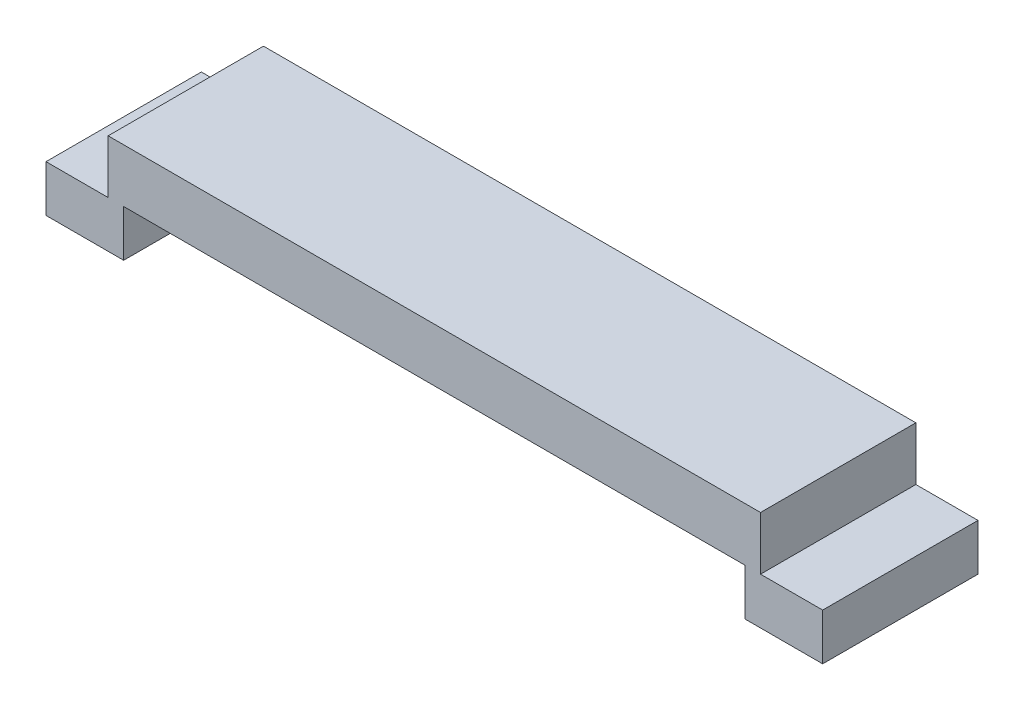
ISO-10303-21;
HEADER;
FILE_DESCRIPTION(('STEP AP214'),'2;1');
FILE_NAME('part.step','',(''),(''),'','','');
FILE_SCHEMA(('AUTOMOTIVE_DESIGN { 1 0 10303 214 1 1 1 1 }'));
ENDSEC;
DATA;
#1=APPLICATION_CONTEXT('core data for automotive mechanical design processes');
#2=APPLICATION_PROTOCOL_DEFINITION('international standard','automotive_design',2000,#1);
#3=PRODUCT_CONTEXT('',#1,'mechanical');
#4=PRODUCT('Part','Part','',(#3));
#5=PRODUCT_RELATED_PRODUCT_CATEGORY('part','',(#4));
#6=PRODUCT_DEFINITION_FORMATION('','',#4);
#7=PRODUCT_DEFINITION_CONTEXT('part definition',#1,'design');
#8=PRODUCT_DEFINITION('design','',#6,#7);
#9=PRODUCT_DEFINITION_SHAPE('','',#8);
#10=(LENGTH_UNIT() NAMED_UNIT(*) SI_UNIT(.MILLI.,.METRE.));
#11=(NAMED_UNIT(*) PLANE_ANGLE_UNIT() SI_UNIT($,.RADIAN.));
#12=(NAMED_UNIT(*) SI_UNIT($,.STERADIAN.) SOLID_ANGLE_UNIT());
#13=UNCERTAINTY_MEASURE_WITH_UNIT(LENGTH_MEASURE(1.E-05),#10,'distance_accuracy_value','');
#14=(GEOMETRIC_REPRESENTATION_CONTEXT(3) GLOBAL_UNCERTAINTY_ASSIGNED_CONTEXT((#13)) GLOBAL_UNIT_ASSIGNED_CONTEXT((#10,
#11,#12)) REPRESENTATION_CONTEXT('',''));
#15=CARTESIAN_POINT('',(0.,0.,0.));
#16=DIRECTION('',(0.,0.,1.));
#17=DIRECTION('',(1.,0.,0.));
#18=AXIS2_PLACEMENT_3D('',#15,#16,#17);
#19=CARTESIAN_POINT('',(0.,0.,100.));
#20=DIRECTION('',(0.,-1.,0.));
#21=DIRECTION('',(1.,0.,0.));
#22=AXIS2_PLACEMENT_3D('',#19,#20,#21);
#23=PLANE('',#22);
#24=DIRECTION('',(-1.,0.,0.));
#25=VECTOR('',#24,1.);
#26=CARTESIAN_POINT('',(0.,0.,0.));
#27=LINE('',#26,#25);
#28=CARTESIAN_POINT('',(450.,0.,0.));
#29=VERTEX_POINT('',#28);
#30=CARTESIAN_POINT('',(50.,0.,0.));
#31=VERTEX_POINT('',#30);
#32=EDGE_CURVE('E156',#29,#31,#27,.T.);
#33=ORIENTED_EDGE('',*,*,#32,.F.);
#34=DIRECTION('',(0.,0.,-1.));
#35=VECTOR('',#34,1.);
#36=CARTESIAN_POINT('',(450.,0.,100.));
#37=LINE('',#36,#35);
#38=CARTESIAN_POINT('',(450.,0.,100.));
#39=VERTEX_POINT('',#38);
#40=EDGE_CURVE('E11',#39,#29,#37,.T.);
#41=ORIENTED_EDGE('',*,*,#40,.F.);
#42=DIRECTION('',(-1.,0.,0.));
#43=VECTOR('',#42,1.);
#44=CARTESIAN_POINT('',(0.,0.,100.));
#45=LINE('',#44,#43);
#46=CARTESIAN_POINT('',(50.,0.,100.));
#47=VERTEX_POINT('',#46);
#48=EDGE_CURVE('E183',#39,#47,#45,.T.);
#49=ORIENTED_EDGE('',*,*,#48,.T.);
#50=DIRECTION('',(0.,0.,-1.));
#51=VECTOR('',#50,1.);
#52=CARTESIAN_POINT('',(50.,0.,100.));
#53=LINE('',#52,#51);
#54=EDGE_CURVE('E101',#47,#31,#53,.T.);
#55=ORIENTED_EDGE('',*,*,#54,.T.);
#56=EDGE_LOOP('',(#33,#41,#49,#55));
#57=FACE_BOUND('',#56,.T.);
#58=ADVANCED_FACE('F38',(#57),#23,.T.);
#59=CARTESIAN_POINT('',(450.,0.,100.));
#60=DIRECTION('',(1.,0.,0.));
#61=DIRECTION('',(0.,0.,-1.));
#62=AXIS2_PLACEMENT_3D('',#59,#60,#61);
#63=PLANE('',#62);
#64=DIRECTION('',(0.,-1.,0.));
#65=VECTOR('',#64,1.);
#66=CARTESIAN_POINT('',(450.,0.,0.));
#67=LINE('',#66,#65);
#68=CARTESIAN_POINT('',(450.,-30.,0.));
#69=VERTEX_POINT('',#68);
#70=EDGE_CURVE('E159',#29,#69,#67,.T.);
#71=ORIENTED_EDGE('',*,*,#70,.T.);
#72=DIRECTION('',(0.,0.,-1.));
#73=VECTOR('',#72,1.);
#74=CARTESIAN_POINT('',(450.,-30.,100.));
#75=LINE('',#74,#73);
#76=CARTESIAN_POINT('',(450.,-30.,100.));
#77=VERTEX_POINT('',#76);
#78=EDGE_CURVE('E46',#77,#69,#75,.T.);
#79=ORIENTED_EDGE('',*,*,#78,.F.);
#80=DIRECTION('',(0.,-1.,0.));
#81=VECTOR('',#80,1.);
#82=CARTESIAN_POINT('',(450.,0.,100.));
#83=LINE('',#82,#81);
#84=EDGE_CURVE('E264',#39,#77,#83,.T.);
#85=ORIENTED_EDGE('',*,*,#84,.F.);
#86=ORIENTED_EDGE('',*,*,#40,.T.);
#87=EDGE_LOOP('',(#71,#79,#85,#86));
#88=FACE_BOUND('',#87,.T.);
#89=ADVANCED_FACE('F257',(#88),#63,.F.);
#90=CARTESIAN_POINT('',(0.,-30.,100.));
#91=DIRECTION('',(0.,1.,0.));
#92=DIRECTION('',(0.,0.,1.));
#93=AXIS2_PLACEMENT_3D('',#90,#91,#92);
#94=PLANE('',#93);
#95=DIRECTION('',(1.,0.,0.));
#96=VECTOR('',#95,1.);
#97=CARTESIAN_POINT('',(0.,-30.,0.));
#98=LINE('',#97,#96);
#99=CARTESIAN_POINT('',(500.,-30.,0.));
#100=VERTEX_POINT('',#99);
#101=EDGE_CURVE('E161',#69,#100,#98,.T.);
#102=ORIENTED_EDGE('',*,*,#101,.T.);
#103=DIRECTION('',(0.,0.,-1.));
#104=VECTOR('',#103,1.);
#105=CARTESIAN_POINT('',(500.,-30.,100.));
#106=LINE('',#105,#104);
#107=CARTESIAN_POINT('',(500.,-30.,100.));
#108=VERTEX_POINT('',#107);
#109=EDGE_CURVE('E198',#108,#100,#106,.T.);
#110=ORIENTED_EDGE('',*,*,#109,.F.);
#111=DIRECTION('',(1.,0.,0.));
#112=VECTOR('',#111,1.);
#113=CARTESIAN_POINT('',(0.,-30.,100.));
#114=LINE('',#113,#112);
#115=EDGE_CURVE('E207',#77,#108,#114,.T.);
#116=ORIENTED_EDGE('',*,*,#115,.F.);
#117=ORIENTED_EDGE('',*,*,#78,.T.);
#118=EDGE_LOOP('',(#102,#110,#116,#117));
#119=FACE_BOUND('',#118,.T.);
#120=ADVANCED_FACE('F205',(#119),#94,.F.);
#121=CARTESIAN_POINT('',(500.,0.,100.));
#122=DIRECTION('',(-1.,0.,0.));
#123=DIRECTION('',(0.,0.,1.));
#124=AXIS2_PLACEMENT_3D('',#121,#122,#123);
#125=PLANE('',#124);
#126=DIRECTION('',(0.,1.,0.));
#127=VECTOR('',#126,1.);
#128=CARTESIAN_POINT('',(500.,0.,0.));
#129=LINE('',#128,#127);
#130=CARTESIAN_POINT('',(500.,0.,0.));
#131=VERTEX_POINT('',#130);
#132=EDGE_CURVE('E163',#100,#131,#129,.T.);
#133=ORIENTED_EDGE('',*,*,#132,.T.);
#134=DIRECTION('',(0.,0.,-1.));
#135=VECTOR('',#134,1.);
#136=CARTESIAN_POINT('',(500.,0.,100.));
#137=LINE('',#136,#135);
#138=CARTESIAN_POINT('',(500.,0.,100.));
#139=VERTEX_POINT('',#138);
#140=EDGE_CURVE('E195',#139,#131,#137,.T.);
#141=ORIENTED_EDGE('',*,*,#140,.F.);
#142=DIRECTION('',(0.,1.,0.));
#143=VECTOR('',#142,1.);
#144=CARTESIAN_POINT('',(500.,0.,100.));
#145=LINE('',#144,#143);
#146=EDGE_CURVE('E226',#108,#139,#145,.T.);
#147=ORIENTED_EDGE('',*,*,#146,.F.);
#148=ORIENTED_EDGE('',*,*,#109,.T.);
#149=EDGE_LOOP('',(#133,#141,#147,#148));
#150=FACE_BOUND('',#149,.T.);
#151=ADVANCED_FACE('F216',(#150),#125,.F.);
#152=CARTESIAN_POINT('',(0.,0.,100.));
#153=DIRECTION('',(0.,-1.,0.));
#154=DIRECTION('',(1.,0.,0.));
#155=AXIS2_PLACEMENT_3D('',#152,#153,#154);
#156=PLANE('',#155);
#157=DIRECTION('',(-1.,0.,0.));
#158=VECTOR('',#157,1.);
#159=CARTESIAN_POINT('',(0.,0.,0.));
#160=LINE('',#159,#158);
#161=CARTESIAN_POINT('',(460.,0.,0.));
#162=VERTEX_POINT('',#161);
#163=EDGE_CURVE('E165',#131,#162,#160,.T.);
#164=ORIENTED_EDGE('',*,*,#163,.T.);
#165=DIRECTION('',(0.,0.,-1.));
#166=VECTOR('',#165,1.);
#167=CARTESIAN_POINT('',(460.,0.,100.));
#168=LINE('',#167,#166);
#169=CARTESIAN_POINT('',(460.,0.,100.));
#170=VERTEX_POINT('',#169);
#171=EDGE_CURVE('E193',#170,#162,#168,.T.);
#172=ORIENTED_EDGE('',*,*,#171,.F.);
#173=DIRECTION('',(-1.,0.,0.));
#174=VECTOR('',#173,1.);
#175=CARTESIAN_POINT('',(0.,0.,100.));
#176=LINE('',#175,#174);
#177=EDGE_CURVE('E222',#139,#170,#176,.T.);
#178=ORIENTED_EDGE('',*,*,#177,.F.);
#179=ORIENTED_EDGE('',*,*,#140,.T.);
#180=EDGE_LOOP('',(#164,#172,#178,#179));
#181=FACE_BOUND('',#180,.T.);
#182=ADVANCED_FACE('F220',(#181),#156,.F.);
#183=CARTESIAN_POINT('',(460.,-7.42057769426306E-13,100.));
#184=DIRECTION('',(1.,0.,0.));
#185=DIRECTION('',(0.,1.,0.));
#186=AXIS2_PLACEMENT_3D('',#183,#184,#185);
#187=PLANE('',#186);
#188=DIRECTION('',(0.,-1.,0.));
#189=VECTOR('',#188,1.);
#190=CARTESIAN_POINT('',(460.,-7.42057769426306E-13,0.));
#191=LINE('',#190,#189);
#192=CARTESIAN_POINT('',(460.,34.4112421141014,0.));
#193=VERTEX_POINT('',#192);
#194=EDGE_CURVE('E168',#193,#162,#191,.T.);
#195=ORIENTED_EDGE('',*,*,#194,.F.);
#196=DIRECTION('',(0.,0.,-1.));
#197=VECTOR('',#196,1.);
#198=CARTESIAN_POINT('',(460.,34.4112421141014,100.));
#199=LINE('',#198,#197);
#200=CARTESIAN_POINT('',(460.,34.4112421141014,100.));
#201=VERTEX_POINT('',#200);
#202=EDGE_CURVE('E191',#201,#193,#199,.T.);
#203=ORIENTED_EDGE('',*,*,#202,.F.);
#204=DIRECTION('',(0.,-1.,0.));
#205=VECTOR('',#204,1.);
#206=CARTESIAN_POINT('',(460.,-7.42057769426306E-13,100.));
#207=LINE('',#206,#205);
#208=EDGE_CURVE('E225',#201,#170,#207,.T.);
#209=ORIENTED_EDGE('',*,*,#208,.T.);
#210=ORIENTED_EDGE('',*,*,#171,.T.);
#211=EDGE_LOOP('',(#195,#203,#209,#210));
#212=FACE_BOUND('',#211,.T.);
#213=ADVANCED_FACE('F293',(#212),#187,.T.);
#214=CARTESIAN_POINT('',(0.,34.4112421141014,100.));
#215=DIRECTION('',(0.,1.,0.));
#216=DIRECTION('',(0.,0.,1.));
#217=AXIS2_PLACEMENT_3D('',#214,#215,#216);
#218=PLANE('',#217);
#219=DIRECTION('',(1.,0.,0.));
#220=VECTOR('',#219,1.);
#221=CARTESIAN_POINT('',(0.,34.4112421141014,0.));
#222=LINE('',#221,#220);
#223=CARTESIAN_POINT('',(40.,34.4112421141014,0.));
#224=VERTEX_POINT('',#223);
#225=EDGE_CURVE('E171',#224,#193,#222,.T.);
#226=ORIENTED_EDGE('',*,*,#225,.F.);
#227=DIRECTION('',(0.,0.,-1.));
#228=VECTOR('',#227,1.);
#229=CARTESIAN_POINT('',(40.,34.4112421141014,100.));
#230=LINE('',#229,#228);
#231=CARTESIAN_POINT('',(40.,34.4112421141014,100.));
#232=VERTEX_POINT('',#231);
#233=EDGE_CURVE('E189',#232,#224,#230,.T.);
#234=ORIENTED_EDGE('',*,*,#233,.F.);
#235=DIRECTION('',(1.,0.,0.));
#236=VECTOR('',#235,1.);
#237=CARTESIAN_POINT('',(0.,34.4112421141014,100.));
#238=LINE('',#237,#236);
#239=EDGE_CURVE('E228',#232,#201,#238,.T.);
#240=ORIENTED_EDGE('',*,*,#239,.T.);
#241=ORIENTED_EDGE('',*,*,#202,.T.);
#242=EDGE_LOOP('',(#226,#234,#240,#241));
#243=FACE_BOUND('',#242,.T.);
#244=ADVANCED_FACE('F243',(#243),#218,.T.);
#245=CARTESIAN_POINT('',(40.,0.,100.));
#246=DIRECTION('',(-1.,0.,0.));
#247=DIRECTION('',(0.,0.,1.));
#248=AXIS2_PLACEMENT_3D('',#245,#246,#247);
#249=PLANE('',#248);
#250=DIRECTION('',(0.,1.,0.));
#251=VECTOR('',#250,1.);
#252=CARTESIAN_POINT('',(40.,0.,0.));
#253=LINE('',#252,#251);
#254=CARTESIAN_POINT('',(40.,0.,0.));
#255=VERTEX_POINT('',#254);
#256=EDGE_CURVE('E174',#255,#224,#253,.T.);
#257=ORIENTED_EDGE('',*,*,#256,.F.);
#258=DIRECTION('',(0.,0.,-1.));
#259=VECTOR('',#258,1.);
#260=CARTESIAN_POINT('',(40.,0.,100.));
#261=LINE('',#260,#259);
#262=CARTESIAN_POINT('',(40.,0.,100.));
#263=VERTEX_POINT('',#262);
#264=EDGE_CURVE('E187',#263,#255,#261,.T.);
#265=ORIENTED_EDGE('',*,*,#264,.F.);
#266=DIRECTION('',(0.,1.,0.));
#267=VECTOR('',#266,1.);
#268=CARTESIAN_POINT('',(40.,0.,100.));
#269=LINE('',#268,#267);
#270=EDGE_CURVE('E235',#263,#232,#269,.T.);
#271=ORIENTED_EDGE('',*,*,#270,.T.);
#272=ORIENTED_EDGE('',*,*,#233,.T.);
#273=EDGE_LOOP('',(#257,#265,#271,#272));
#274=FACE_BOUND('',#273,.T.);
#275=ADVANCED_FACE('F239',(#274),#249,.T.);
#276=CARTESIAN_POINT('',(0.,0.,100.));
#277=DIRECTION('',(0.,-1.,0.));
#278=DIRECTION('',(1.,0.,0.));
#279=AXIS2_PLACEMENT_3D('',#276,#277,#278);
#280=PLANE('',#279);
#281=DIRECTION('',(-1.,0.,0.));
#282=VECTOR('',#281,1.);
#283=CARTESIAN_POINT('',(0.,0.,0.));
#284=LINE('',#283,#282);
#285=CARTESIAN_POINT('',(0.,0.,0.));
#286=VERTEX_POINT('',#285);
#287=EDGE_CURVE('E177',#255,#286,#284,.T.);
#288=ORIENTED_EDGE('',*,*,#287,.T.);
#289=DIRECTION('',(0.,0.,-1.));
#290=VECTOR('',#289,1.);
#291=CARTESIAN_POINT('',(0.,0.,100.));
#292=LINE('',#291,#290);
#293=CARTESIAN_POINT('',(0.,0.,100.));
#294=VERTEX_POINT('',#293);
#295=EDGE_CURVE('E148',#294,#286,#292,.T.);
#296=ORIENTED_EDGE('',*,*,#295,.F.);
#297=DIRECTION('',(-1.,0.,0.));
#298=VECTOR('',#297,1.);
#299=CARTESIAN_POINT('',(0.,0.,100.));
#300=LINE('',#299,#298);
#301=EDGE_CURVE('E139',#263,#294,#300,.T.);
#302=ORIENTED_EDGE('',*,*,#301,.F.);
#303=ORIENTED_EDGE('',*,*,#264,.T.);
#304=EDGE_LOOP('',(#288,#296,#302,#303));
#305=FACE_BOUND('',#304,.T.);
#306=ADVANCED_FACE('F247',(#305),#280,.F.);
#307=CARTESIAN_POINT('',(0.,0.,100.));
#308=DIRECTION('',(1.,0.,0.));
#309=DIRECTION('',(0.,0.,-1.));
#310=AXIS2_PLACEMENT_3D('',#307,#308,#309);
#311=PLANE('',#310);
#312=DIRECTION('',(0.,-1.,0.));
#313=VECTOR('',#312,1.);
#314=CARTESIAN_POINT('',(0.,0.,0.));
#315=LINE('',#314,#313);
#316=CARTESIAN_POINT('',(0.,-30.,0.));
#317=VERTEX_POINT('',#316);
#318=EDGE_CURVE('E147',#286,#317,#315,.T.);
#319=ORIENTED_EDGE('',*,*,#318,.T.);
#320=DIRECTION('',(0.,0.,-1.));
#321=VECTOR('',#320,1.);
#322=CARTESIAN_POINT('',(0.,-30.,100.));
#323=LINE('',#322,#321);
#324=CARTESIAN_POINT('',(0.,-30.,100.));
#325=VERTEX_POINT('',#324);
#326=EDGE_CURVE('E144',#325,#317,#323,.T.);
#327=ORIENTED_EDGE('',*,*,#326,.F.);
#328=DIRECTION('',(0.,-1.,0.));
#329=VECTOR('',#328,1.);
#330=CARTESIAN_POINT('',(0.,0.,100.));
#331=LINE('',#330,#329);
#332=EDGE_CURVE('E132',#294,#325,#331,.T.);
#333=ORIENTED_EDGE('',*,*,#332,.F.);
#334=ORIENTED_EDGE('',*,*,#295,.T.);
#335=EDGE_LOOP('',(#319,#327,#333,#334));
#336=FACE_BOUND('',#335,.T.);
#337=ADVANCED_FACE('F145',(#336),#311,.F.);
#338=CARTESIAN_POINT('',(0.,-30.,100.));
#339=DIRECTION('',(0.,1.,0.));
#340=DIRECTION('',(0.,0.,1.));
#341=AXIS2_PLACEMENT_3D('',#338,#339,#340);
#342=PLANE('',#341);
#343=DIRECTION('',(1.,0.,0.));
#344=VECTOR('',#343,1.);
#345=CARTESIAN_POINT('',(0.,-30.,0.));
#346=LINE('',#345,#344);
#347=CARTESIAN_POINT('',(50.,-30.,0.));
#348=VERTEX_POINT('',#347);
#349=EDGE_CURVE('E94',#317,#348,#346,.T.);
#350=ORIENTED_EDGE('',*,*,#349,.T.);
#351=DIRECTION('',(0.,0.,-1.));
#352=VECTOR('',#351,1.);
#353=CARTESIAN_POINT('',(50.,-30.,100.));
#354=LINE('',#353,#352);
#355=CARTESIAN_POINT('',(50.,-30.,100.));
#356=VERTEX_POINT('',#355);
#357=EDGE_CURVE('E149',#356,#348,#354,.T.);
#358=ORIENTED_EDGE('',*,*,#357,.F.);
#359=DIRECTION('',(1.,0.,0.));
#360=VECTOR('',#359,1.);
#361=CARTESIAN_POINT('',(0.,-30.,100.));
#362=LINE('',#361,#360);
#363=EDGE_CURVE('E136',#325,#356,#362,.T.);
#364=ORIENTED_EDGE('',*,*,#363,.F.);
#365=ORIENTED_EDGE('',*,*,#326,.T.);
#366=EDGE_LOOP('',(#350,#358,#364,#365));
#367=FACE_BOUND('',#366,.T.);
#368=ADVANCED_FACE('F151',(#367),#342,.F.);
#369=CARTESIAN_POINT('',(50.,0.,100.));
#370=DIRECTION('',(-1.,0.,0.));
#371=DIRECTION('',(0.,0.,1.));
#372=AXIS2_PLACEMENT_3D('',#369,#370,#371);
#373=PLANE('',#372);
#374=DIRECTION('',(0.,1.,0.));
#375=VECTOR('',#374,1.);
#376=CARTESIAN_POINT('',(50.,0.,0.));
#377=LINE('',#376,#375);
#378=EDGE_CURVE('E181',#348,#31,#377,.T.);
#379=ORIENTED_EDGE('',*,*,#378,.T.);
#380=ORIENTED_EDGE('',*,*,#54,.F.);
#381=DIRECTION('',(0.,1.,0.));
#382=VECTOR('',#381,1.);
#383=CARTESIAN_POINT('',(50.,0.,100.));
#384=LINE('',#383,#382);
#385=EDGE_CURVE('E54',#356,#47,#384,.T.);
#386=ORIENTED_EDGE('',*,*,#385,.F.);
#387=ORIENTED_EDGE('',*,*,#357,.T.);
#388=EDGE_LOOP('',(#379,#380,#386,#387));
#389=FACE_BOUND('',#388,.T.);
#390=ADVANCED_FACE('F263',(#389),#373,.F.);
#391=CARTESIAN_POINT('',(0.,0.,100.));
#392=DIRECTION('',(0.,0.,1.));
#393=DIRECTION('',(1.,0.,0.));
#394=AXIS2_PLACEMENT_3D('',#391,#392,#393);
#395=PLANE('',#394);
#396=ORIENTED_EDGE('',*,*,#48,.F.);
#397=ORIENTED_EDGE('',*,*,#84,.T.);
#398=ORIENTED_EDGE('',*,*,#115,.T.);
#399=ORIENTED_EDGE('',*,*,#146,.T.);
#400=ORIENTED_EDGE('',*,*,#177,.T.);
#401=ORIENTED_EDGE('',*,*,#208,.F.);
#402=ORIENTED_EDGE('',*,*,#239,.F.);
#403=ORIENTED_EDGE('',*,*,#270,.F.);
#404=ORIENTED_EDGE('',*,*,#301,.T.);
#405=ORIENTED_EDGE('',*,*,#332,.T.);
#406=ORIENTED_EDGE('',*,*,#363,.T.);
#407=ORIENTED_EDGE('',*,*,#385,.T.);
#408=EDGE_LOOP('',(#396,#397,#398,#399,#400,#401,#402,#403,#404,#405,#406,#407));
#409=FACE_BOUND('',#408,.T.);
#410=ADVANCED_FACE('F134',(#409),#395,.T.);
#411=CARTESIAN_POINT('',(0.,0.,0.));
#412=DIRECTION('',(0.,0.,1.));
#413=DIRECTION('',(1.,0.,0.));
#414=AXIS2_PLACEMENT_3D('',#411,#412,#413);
#415=PLANE('',#414);
#416=ORIENTED_EDGE('',*,*,#32,.T.);
#417=ORIENTED_EDGE('',*,*,#378,.F.);
#418=ORIENTED_EDGE('',*,*,#349,.F.);
#419=ORIENTED_EDGE('',*,*,#318,.F.);
#420=ORIENTED_EDGE('',*,*,#287,.F.);
#421=ORIENTED_EDGE('',*,*,#256,.T.);
#422=ORIENTED_EDGE('',*,*,#225,.T.);
#423=ORIENTED_EDGE('',*,*,#194,.T.);
#424=ORIENTED_EDGE('',*,*,#163,.F.);
#425=ORIENTED_EDGE('',*,*,#132,.F.);
#426=ORIENTED_EDGE('',*,*,#101,.F.);
#427=ORIENTED_EDGE('',*,*,#70,.F.);
#428=EDGE_LOOP('',(#416,#417,#418,#419,#420,#421,#422,#423,#424,#425,#426,#427));
#429=FACE_BOUND('',#428,.T.);
#430=ADVANCED_FACE('F212',(#429),#415,.F.);
#431=CLOSED_SHELL('',(#58,#89,#120,#151,#182,#213,#244,#275,#306,#337,#368,#390,#410,#430));
#432=MANIFOLD_SOLID_BREP('B2',#431);
#433=ADVANCED_BREP_SHAPE_REPRESENTATION('',(#18,#432),#14);
#434=SHAPE_DEFINITION_REPRESENTATION(#9,#433);
ENDSEC;
END-ISO-10303-21;
